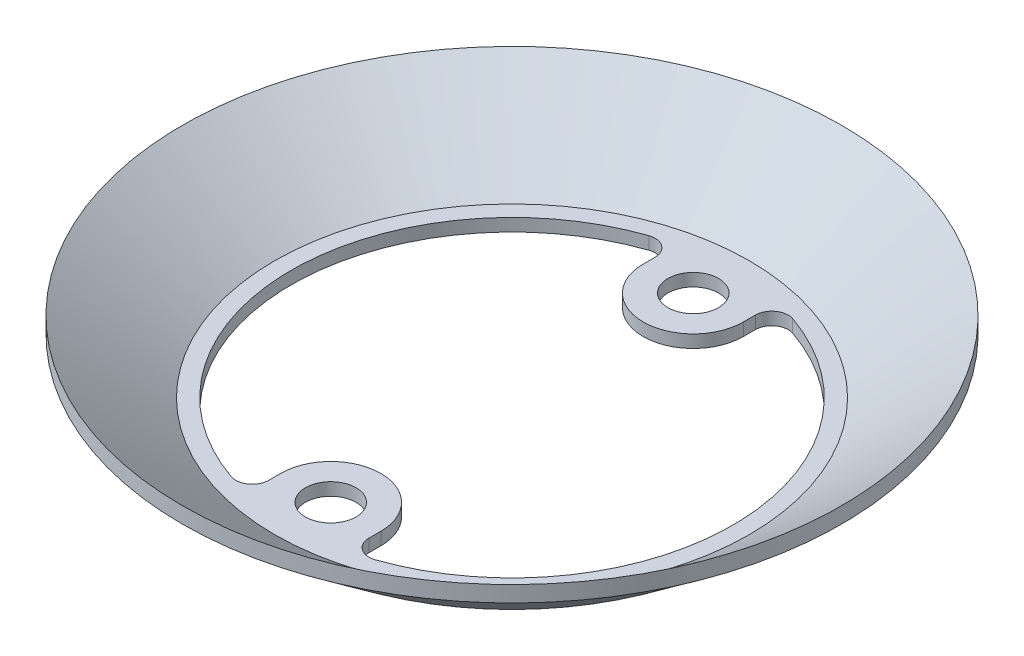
ISO-10303-21;
HEADER;
FILE_DESCRIPTION(('STEP AP214'),'2;1');
FILE_NAME('part.step','',(''),(''),'','','');
FILE_SCHEMA(('AUTOMOTIVE_DESIGN { 1 0 10303 214 1 1 1 1 }'));
ENDSEC;
DATA;
#1=APPLICATION_CONTEXT('core data for automotive mechanical design processes');
#2=APPLICATION_PROTOCOL_DEFINITION('international standard','automotive_design',2000,#1);
#3=PRODUCT_CONTEXT('',#1,'mechanical');
#4=PRODUCT('Part','Part','',(#3));
#5=PRODUCT_RELATED_PRODUCT_CATEGORY('part','',(#4));
#6=PRODUCT_DEFINITION_FORMATION('','',#4);
#7=PRODUCT_DEFINITION_CONTEXT('part definition',#1,'design');
#8=PRODUCT_DEFINITION('design','',#6,#7);
#9=PRODUCT_DEFINITION_SHAPE('','',#8);
#10=(LENGTH_UNIT() NAMED_UNIT(*) SI_UNIT(.MILLI.,.METRE.));
#11=(NAMED_UNIT(*) PLANE_ANGLE_UNIT() SI_UNIT($,.RADIAN.));
#12=(NAMED_UNIT(*) SI_UNIT($,.STERADIAN.) SOLID_ANGLE_UNIT());
#13=UNCERTAINTY_MEASURE_WITH_UNIT(LENGTH_MEASURE(1.E-05),#10,'distance_accuracy_value','');
#14=(GEOMETRIC_REPRESENTATION_CONTEXT(3) GLOBAL_UNCERTAINTY_ASSIGNED_CONTEXT((#13)) GLOBAL_UNIT_ASSIGNED_CONTEXT((#10,
#11,#12)) REPRESENTATION_CONTEXT('',''));
#15=CARTESIAN_POINT('',(0.,0.,0.));
#16=DIRECTION('',(0.,0.,1.));
#17=DIRECTION('',(1.,0.,0.));
#18=AXIS2_PLACEMENT_3D('',#15,#16,#17);
#19=CARTESIAN_POINT('',(0.,0.,0.));
#20=DIRECTION('',(0.,-1.,0.));
#21=DIRECTION('',(0.,0.,-1.));
#22=AXIS2_PLACEMENT_3D('',#19,#20,#21);
#23=CYLINDRICAL_SURFACE('',#22,21.2725);
#24=CARTESIAN_POINT('',(0.,0.,0.));
#25=DIRECTION('',(0.,-1.,0.));
#26=DIRECTION('',(0.,0.,-1.));
#27=AXIS2_PLACEMENT_3D('',#24,#25,#26);
#28=CIRCLE('',#27,21.2725);
#29=CARTESIAN_POINT('',(6.93071774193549,0.,-20.1117977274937));
#30=VERTEX_POINT('',#29);
#31=CARTESIAN_POINT('',(6.93071774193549,0.,20.1117977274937));
#32=VERTEX_POINT('',#31);
#33=EDGE_CURVE('E195',#30,#32,#28,.T.);
#34=ORIENTED_EDGE('',*,*,#33,.T.);
#35=DIRECTION('',(0.,-1.,0.));
#36=VECTOR('',#35,1.);
#37=CARTESIAN_POINT('',(6.93071774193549,0.,20.1117977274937));
#38=LINE('',#37,#36);
#39=CARTESIAN_POINT('',(6.93071774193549,1.2192,20.1117977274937));
#40=VERTEX_POINT('',#39);
#41=EDGE_CURVE('E211',#32,#40,#38,.F.);
#42=ORIENTED_EDGE('',*,*,#41,.T.);
#43=CARTESIAN_POINT('',(0.,1.2192,0.));
#44=DIRECTION('',(0.,-1.,0.));
#45=DIRECTION('',(0.,0.,-1.));
#46=AXIS2_PLACEMENT_3D('',#43,#44,#45);
#47=CIRCLE('',#46,21.2725);
#48=CARTESIAN_POINT('',(6.93071774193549,1.2192,-20.1117977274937));
#49=VERTEX_POINT('',#48);
#50=EDGE_CURVE('E199',#49,#40,#47,.T.);
#51=ORIENTED_EDGE('',*,*,#50,.F.);
#52=DIRECTION('',(0.,-1.,0.));
#53=VECTOR('',#52,1.);
#54=CARTESIAN_POINT('',(6.93071774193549,0.,-20.1117977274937));
#55=LINE('',#54,#53);
#56=EDGE_CURVE('E209',#49,#30,#55,.T.);
#57=ORIENTED_EDGE('',*,*,#56,.T.);
#58=EDGE_LOOP('',(#34,#42,#51,#57));
#59=FACE_BOUND('',#58,.T.);
#60=ADVANCED_FACE('F35',(#59),#23,.F.);
#61=CARTESIAN_POINT('',(-6.93071774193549,1.2192,20.1117977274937));
#62=VERTEX_POINT('',#61);
#63=CARTESIAN_POINT('',(-6.93071774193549,1.2192,-20.1117977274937));
#64=VERTEX_POINT('',#63);
#65=EDGE_CURVE('E196',#62,#64,#47,.T.);
#66=ORIENTED_EDGE('',*,*,#65,.F.);
#67=DIRECTION('',(0.,-1.,0.));
#68=VECTOR('',#67,1.);
#69=CARTESIAN_POINT('',(-6.93071774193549,0.,20.1117977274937));
#70=LINE('',#69,#68);
#71=CARTESIAN_POINT('',(-6.93071774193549,0.,20.1117977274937));
#72=VERTEX_POINT('',#71);
#73=EDGE_CURVE('E218',#62,#72,#70,.T.);
#74=ORIENTED_EDGE('',*,*,#73,.T.);
#75=CARTESIAN_POINT('',(-6.93071774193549,0.,-20.1117977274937));
#76=VERTEX_POINT('',#75);
#77=EDGE_CURVE('E192',#72,#76,#28,.T.);
#78=ORIENTED_EDGE('',*,*,#77,.T.);
#79=DIRECTION('',(0.,-1.,0.));
#80=VECTOR('',#79,1.);
#81=CARTESIAN_POINT('',(-6.93071774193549,0.,-20.1117977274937));
#82=LINE('',#81,#80);
#83=EDGE_CURVE('E216',#76,#64,#82,.F.);
#84=ORIENTED_EDGE('',*,*,#83,.T.);
#85=EDGE_LOOP('',(#66,#74,#78,#84));
#86=FACE_BOUND('',#85,.T.);
#87=ADVANCED_FACE('F263',(#86),#23,.F.);
#88=CARTESIAN_POINT('',(0.,0.,0.));
#89=DIRECTION('',(0.,1.,0.));
#90=DIRECTION('',(0.,0.,1.));
#91=AXIS2_PLACEMENT_3D('',#88,#89,#90);
#92=CONICAL_SURFACE('',#91,23.2756149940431,0.913721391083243);
#93=CARTESIAN_POINT('',(0.,6.53738271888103,0.));
#94=DIRECTION('',(0.,-1.,0.));
#95=DIRECTION('',(0.,0.,-1.));
#96=AXIS2_PLACEMENT_3D('',#93,#94,#95);
#97=CIRCLE('',#96,31.75);
#98=CARTESIAN_POINT('',(0.,6.53738271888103,-31.75));
#99=VERTEX_POINT('',#98);
#100=EDGE_CURVE('E206',#99,#99,#97,.T.);
#101=ORIENTED_EDGE('',*,*,#100,.T.);
#102=EDGE_LOOP('',(#101));
#103=FACE_BOUND('',#102,.T.);
#104=CARTESIAN_POINT('',(0.,0.,0.));
#105=DIRECTION('',(0.,-1.,0.));
#106=DIRECTION('',(0.,0.,-1.));
#107=AXIS2_PLACEMENT_3D('',#104,#105,#106);
#108=CIRCLE('',#107,23.2756149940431);
#109=CARTESIAN_POINT('',(0.,0.,-23.2756149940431));
#110=VERTEX_POINT('',#109);
#111=EDGE_CURVE('E188',#110,#110,#108,.T.);
#112=ORIENTED_EDGE('',*,*,#111,.F.);
#113=EDGE_LOOP('',(#112));
#114=FACE_BOUND('',#113,.T.);
#115=ADVANCED_FACE('F292',(#103,#114),#92,.T.);
#116=CARTESIAN_POINT('',(0.,0.,0.));
#117=DIRECTION('',(0.,-1.,0.));
#118=DIRECTION('',(0.,0.,-1.));
#119=AXIS2_PLACEMENT_3D('',#116,#117,#118);
#120=CYLINDRICAL_SURFACE('',#119,31.75);
#121=CARTESIAN_POINT('',(0.,8.0772,0.));
#122=DIRECTION('',(0.,-1.,0.));
#123=DIRECTION('',(0.,0.,-1.));
#124=AXIS2_PLACEMENT_3D('',#121,#122,#123);
#125=CIRCLE('',#124,31.75);
#126=CARTESIAN_POINT('',(0.,8.0772,-31.75));
#127=VERTEX_POINT('',#126);
#128=EDGE_CURVE('E203',#127,#127,#125,.T.);
#129=ORIENTED_EDGE('',*,*,#128,.T.);
#130=EDGE_LOOP('',(#129));
#131=FACE_BOUND('',#130,.T.);
#132=ORIENTED_EDGE('',*,*,#100,.F.);
#133=EDGE_LOOP('',(#132));
#134=FACE_BOUND('',#133,.T.);
#135=ADVANCED_FACE('F301',(#131,#134),#120,.T.);
#136=CARTESIAN_POINT('',(0.,8.0772,0.));
#137=DIRECTION('',(0.,1.,0.));
#138=DIRECTION('',(0.,0.,1.));
#139=AXIS2_PLACEMENT_3D('',#136,#137,#138);
#140=CONICAL_SURFACE('',#139,31.75,0.913721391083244);
#141=CARTESIAN_POINT('',(0.,1.2192,0.));
#142=DIRECTION('',(0.,-1.,0.));
#143=DIRECTION('',(0.,0.,-1.));
#144=AXIS2_PLACEMENT_3D('',#141,#142,#143);
#145=CIRCLE('',#144,22.86);
#146=CARTESIAN_POINT('',(0.,1.2192,-22.86));
#147=VERTEX_POINT('',#146);
#148=EDGE_CURVE('E200',#147,#147,#145,.T.);
#149=ORIENTED_EDGE('',*,*,#148,.T.);
#150=EDGE_LOOP('',(#149));
#151=FACE_BOUND('',#150,.T.);
#152=ORIENTED_EDGE('',*,*,#128,.F.);
#153=EDGE_LOOP('',(#152));
#154=FACE_BOUND('',#153,.T.);
#155=ADVANCED_FACE('F298',(#151,#154),#140,.F.);
#156=CARTESIAN_POINT('',(0.,1.2192,-22.86));
#157=DIRECTION('',(0.,1.,0.));
#158=DIRECTION('',(0.,0.,1.));
#159=AXIS2_PLACEMENT_3D('',#156,#157,#158);
#160=PLANE('',#159);
#161=DIRECTION('',(0.,0.,-1.));
#162=VECTOR('',#161,1.);
#163=CARTESIAN_POINT('',(4.826,1.2192,-17.4625));
#164=LINE('',#163,#162);
#165=CARTESIAN_POINT('',(4.826,1.2192,-17.4625));
#166=VERTEX_POINT('',#165);
#167=CARTESIAN_POINT('',(4.826,1.2192,-18.6109173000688));
#168=VERTEX_POINT('',#167);
#169=EDGE_CURVE('E181',#166,#168,#164,.T.);
#170=ORIENTED_EDGE('',*,*,#169,.T.);
#171=CARTESIAN_POINT('',(6.4135,1.2192,-18.6109173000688));
#172=DIRECTION('',(0.,1.,0.));
#173=DIRECTION('',(0.,0.,1.));
#174=AXIS2_PLACEMENT_3D('',#171,#172,#173);
#175=CIRCLE('',#174,1.5875);
#176=EDGE_CURVE('E43',#168,#49,#175,.F.);
#177=ORIENTED_EDGE('',*,*,#176,.T.);
#178=ORIENTED_EDGE('',*,*,#50,.T.);
#179=CARTESIAN_POINT('',(6.4135,1.2192,18.6109173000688));
#180=DIRECTION('',(0.,1.,0.));
#181=DIRECTION('',(0.,0.,1.));
#182=AXIS2_PLACEMENT_3D('',#179,#180,#181);
#183=CIRCLE('',#182,1.5875);
#184=CARTESIAN_POINT('',(4.826,1.2192,18.6109173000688));
#185=VERTEX_POINT('',#184);
#186=EDGE_CURVE('E228',#40,#185,#183,.F.);
#187=ORIENTED_EDGE('',*,*,#186,.T.);
#188=DIRECTION('',(0.,0.,1.));
#189=VECTOR('',#188,1.);
#190=CARTESIAN_POINT('',(4.826,1.2192,17.4625));
#191=LINE('',#190,#189);
#192=CARTESIAN_POINT('',(4.826,1.2192,17.4625));
#193=VERTEX_POINT('',#192);
#194=EDGE_CURVE('E149',#193,#185,#191,.T.);
#195=ORIENTED_EDGE('',*,*,#194,.F.);
#196=CARTESIAN_POINT('',(0.,1.2192,17.4625));
#197=DIRECTION('',(0.,-1.,0.));
#198=DIRECTION('',(0.,0.,-1.));
#199=AXIS2_PLACEMENT_3D('',#196,#197,#198);
#200=CIRCLE('',#199,4.826);
#201=CARTESIAN_POINT('',(-4.826,1.2192,17.4625));
#202=VERTEX_POINT('',#201);
#203=EDGE_CURVE('E158',#202,#193,#200,.T.);
#204=ORIENTED_EDGE('',*,*,#203,.F.);
#205=DIRECTION('',(0.,0.,-1.));
#206=VECTOR('',#205,1.);
#207=CARTESIAN_POINT('',(-4.826,1.2192,17.4625));
#208=LINE('',#207,#206);
#209=CARTESIAN_POINT('',(-4.826,1.2192,18.6109173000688));
#210=VERTEX_POINT('',#209);
#211=EDGE_CURVE('E141',#210,#202,#208,.T.);
#212=ORIENTED_EDGE('',*,*,#211,.F.);
#213=CARTESIAN_POINT('',(-6.4135,1.2192,18.6109173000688));
#214=DIRECTION('',(0.,1.,0.));
#215=DIRECTION('',(0.,0.,1.));
#216=AXIS2_PLACEMENT_3D('',#213,#214,#215);
#217=CIRCLE('',#216,1.5875);
#218=EDGE_CURVE('E233',#210,#62,#217,.F.);
#219=ORIENTED_EDGE('',*,*,#218,.T.);
#220=ORIENTED_EDGE('',*,*,#65,.T.);
#221=CARTESIAN_POINT('',(-6.4135,1.2192,-18.6109173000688));
#222=DIRECTION('',(0.,1.,0.));
#223=DIRECTION('',(0.,0.,1.));
#224=AXIS2_PLACEMENT_3D('',#221,#222,#223);
#225=CIRCLE('',#224,1.5875);
#226=CARTESIAN_POINT('',(-4.826,1.2192,-18.6109173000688));
#227=VERTEX_POINT('',#226);
#228=EDGE_CURVE('E237',#64,#227,#225,.F.);
#229=ORIENTED_EDGE('',*,*,#228,.T.);
#230=DIRECTION('',(0.,0.,1.));
#231=VECTOR('',#230,1.);
#232=CARTESIAN_POINT('',(-4.826,1.2192,-17.4625));
#233=LINE('',#232,#231);
#234=CARTESIAN_POINT('',(-4.826,1.2192,-17.4625));
#235=VERTEX_POINT('',#234);
#236=EDGE_CURVE('E174',#227,#235,#233,.T.);
#237=ORIENTED_EDGE('',*,*,#236,.T.);
#238=CARTESIAN_POINT('',(0.,1.2192,-17.4625));
#239=DIRECTION('',(0.,1.,0.));
#240=DIRECTION('',(0.,0.,1.));
#241=AXIS2_PLACEMENT_3D('',#238,#239,#240);
#242=CIRCLE('',#241,4.826);
#243=EDGE_CURVE('E167',#235,#166,#242,.T.);
#244=ORIENTED_EDGE('',*,*,#243,.T.);
#245=EDGE_LOOP('',(#170,#177,#178,#187,#195,#204,#212,#219,#220,#229,#237,#244));
#246=FACE_BOUND('',#245,.T.);
#247=CARTESIAN_POINT('',(0.,1.2192,17.4625));
#248=DIRECTION('',(0.,-1.,0.));
#249=DIRECTION('',(0.,0.,-1.));
#250=AXIS2_PLACEMENT_3D('',#247,#248,#249);
#251=CIRCLE('',#250,2.4384);
#252=CARTESIAN_POINT('',(0.,1.2192,15.0241));
#253=VERTEX_POINT('',#252);
#254=EDGE_CURVE('E154',#253,#253,#251,.T.);
#255=ORIENTED_EDGE('',*,*,#254,.T.);
#256=EDGE_LOOP('',(#255));
#257=FACE_BOUND('',#256,.T.);
#258=CARTESIAN_POINT('',(0.,1.2192,-17.4625));
#259=DIRECTION('',(0.,1.,0.));
#260=DIRECTION('',(0.,0.,1.));
#261=AXIS2_PLACEMENT_3D('',#258,#259,#260);
#262=CIRCLE('',#261,2.4384);
#263=CARTESIAN_POINT('',(0.,1.2192,-15.0241));
#264=VERTEX_POINT('',#263);
#265=EDGE_CURVE('E162',#264,#264,#262,.T.);
#266=ORIENTED_EDGE('',*,*,#265,.F.);
#267=EDGE_LOOP('',(#266));
#268=FACE_BOUND('',#267,.T.);
#269=ORIENTED_EDGE('',*,*,#148,.F.);
#270=EDGE_LOOP('',(#269));
#271=FACE_BOUND('',#270,.T.);
#272=ADVANCED_FACE('F241',(#246,#257,#268,#271),#160,.T.);
#273=CARTESIAN_POINT('',(0.,0.,-23.2756149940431));
#274=DIRECTION('',(0.,-1.,0.));
#275=DIRECTION('',(0.,0.,-1.));
#276=AXIS2_PLACEMENT_3D('',#273,#274,#275);
#277=PLANE('',#276);
#278=ORIENTED_EDGE('',*,*,#77,.F.);
#279=CARTESIAN_POINT('',(-6.4135,0.,18.6109173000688));
#280=DIRECTION('',(0.,-1.,0.));
#281=DIRECTION('',(0.,0.,-1.));
#282=AXIS2_PLACEMENT_3D('',#279,#280,#281);
#283=CIRCLE('',#282,1.5875);
#284=CARTESIAN_POINT('',(-4.826,0.,18.6109173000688));
#285=VERTEX_POINT('',#284);
#286=EDGE_CURVE('E132',#72,#285,#283,.F.);
#287=ORIENTED_EDGE('',*,*,#286,.T.);
#288=DIRECTION('',(0.,0.,-1.));
#289=VECTOR('',#288,1.);
#290=CARTESIAN_POINT('',(-4.826,0.,17.4625));
#291=LINE('',#290,#289);
#292=CARTESIAN_POINT('',(-4.826,0.,17.4625));
#293=VERTEX_POINT('',#292);
#294=EDGE_CURVE('E123',#285,#293,#291,.T.);
#295=ORIENTED_EDGE('',*,*,#294,.T.);
#296=CARTESIAN_POINT('',(0.,0.,17.4625));
#297=DIRECTION('',(0.,-1.,0.));
#298=DIRECTION('',(0.,0.,-1.));
#299=AXIS2_PLACEMENT_3D('',#296,#297,#298);
#300=CIRCLE('',#299,4.826);
#301=CARTESIAN_POINT('',(4.826,0.,17.4625));
#302=VERTEX_POINT('',#301);
#303=EDGE_CURVE('E130',#293,#302,#300,.T.);
#304=ORIENTED_EDGE('',*,*,#303,.T.);
#305=DIRECTION('',(0.,0.,1.));
#306=VECTOR('',#305,1.);
#307=CARTESIAN_POINT('',(4.826,0.,17.4625));
#308=LINE('',#307,#306);
#309=CARTESIAN_POINT('',(4.826,0.,18.6109173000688));
#310=VERTEX_POINT('',#309);
#311=EDGE_CURVE('E135',#302,#310,#308,.T.);
#312=ORIENTED_EDGE('',*,*,#311,.T.);
#313=CARTESIAN_POINT('',(6.4135,0.,18.6109173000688));
#314=DIRECTION('',(0.,-1.,0.));
#315=DIRECTION('',(0.,0.,-1.));
#316=AXIS2_PLACEMENT_3D('',#313,#314,#315);
#317=CIRCLE('',#316,1.5875);
#318=EDGE_CURVE('E230',#310,#32,#317,.F.);
#319=ORIENTED_EDGE('',*,*,#318,.T.);
#320=ORIENTED_EDGE('',*,*,#33,.F.);
#321=CARTESIAN_POINT('',(6.4135,0.,-18.6109173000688));
#322=DIRECTION('',(0.,-1.,0.));
#323=DIRECTION('',(0.,0.,-1.));
#324=AXIS2_PLACEMENT_3D('',#321,#322,#323);
#325=CIRCLE('',#324,1.5875);
#326=CARTESIAN_POINT('',(4.826,0.,-18.6109173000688));
#327=VERTEX_POINT('',#326);
#328=EDGE_CURVE('E11',#30,#327,#325,.F.);
#329=ORIENTED_EDGE('',*,*,#328,.T.);
#330=DIRECTION('',(0.,0.,-1.));
#331=VECTOR('',#330,1.);
#332=CARTESIAN_POINT('',(4.826,0.,-17.4625));
#333=LINE('',#332,#331);
#334=CARTESIAN_POINT('',(4.826,0.,-17.4625));
#335=VERTEX_POINT('',#334);
#336=EDGE_CURVE('E173',#335,#327,#333,.T.);
#337=ORIENTED_EDGE('',*,*,#336,.F.);
#338=CARTESIAN_POINT('',(0.,0.,-17.4625));
#339=DIRECTION('',(0.,1.,0.));
#340=DIRECTION('',(0.,0.,1.));
#341=AXIS2_PLACEMENT_3D('',#338,#339,#340);
#342=CIRCLE('',#341,4.826);
#343=CARTESIAN_POINT('',(-4.826,0.,-17.4625));
#344=VERTEX_POINT('',#343);
#345=EDGE_CURVE('E170',#344,#335,#342,.T.);
#346=ORIENTED_EDGE('',*,*,#345,.F.);
#347=DIRECTION('',(0.,0.,1.));
#348=VECTOR('',#347,1.);
#349=CARTESIAN_POINT('',(-4.826,0.,-17.4625));
#350=LINE('',#349,#348);
#351=CARTESIAN_POINT('',(-4.826,0.,-18.6109173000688));
#352=VERTEX_POINT('',#351);
#353=EDGE_CURVE('E176',#352,#344,#350,.T.);
#354=ORIENTED_EDGE('',*,*,#353,.F.);
#355=CARTESIAN_POINT('',(-6.4135,0.,-18.6109173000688));
#356=DIRECTION('',(0.,-1.,0.));
#357=DIRECTION('',(0.,0.,-1.));
#358=AXIS2_PLACEMENT_3D('',#355,#356,#357);
#359=CIRCLE('',#358,1.5875);
#360=EDGE_CURVE('E235',#352,#76,#359,.F.);
#361=ORIENTED_EDGE('',*,*,#360,.T.);
#362=EDGE_LOOP('',(#278,#287,#295,#304,#312,#319,#320,#329,#337,#346,#354,#361));
#363=FACE_BOUND('',#362,.T.);
#364=CARTESIAN_POINT('',(0.,0.,-17.4625));
#365=DIRECTION('',(0.,1.,0.));
#366=DIRECTION('',(0.,0.,1.));
#367=AXIS2_PLACEMENT_3D('',#364,#365,#366);
#368=CIRCLE('',#367,2.4384);
#369=CARTESIAN_POINT('',(0.,0.,-15.0241));
#370=VERTEX_POINT('',#369);
#371=EDGE_CURVE('E164',#370,#370,#368,.T.);
#372=ORIENTED_EDGE('',*,*,#371,.T.);
#373=EDGE_LOOP('',(#372));
#374=FACE_BOUND('',#373,.T.);
#375=ORIENTED_EDGE('',*,*,#111,.T.);
#376=EDGE_LOOP('',(#375));
#377=FACE_BOUND('',#376,.T.);
#378=CARTESIAN_POINT('',(0.,0.,17.4625));
#379=DIRECTION('',(0.,-1.,0.));
#380=DIRECTION('',(0.,0.,-1.));
#381=AXIS2_PLACEMENT_3D('',#378,#379,#380);
#382=CIRCLE('',#381,2.4384);
#383=CARTESIAN_POINT('',(0.,0.,15.0241));
#384=VERTEX_POINT('',#383);
#385=EDGE_CURVE('E160',#384,#384,#382,.T.);
#386=ORIENTED_EDGE('',*,*,#385,.F.);
#387=EDGE_LOOP('',(#386));
#388=FACE_BOUND('',#387,.T.);
#389=ADVANCED_FACE('F126',(#363,#374,#377,#388),#277,.T.);
#390=CARTESIAN_POINT('',(0.,0.,-17.4625));
#391=DIRECTION('',(0.,1.,0.));
#392=DIRECTION('',(0.,0.,1.));
#393=AXIS2_PLACEMENT_3D('',#390,#391,#392);
#394=CYLINDRICAL_SURFACE('',#393,4.826);
#395=ORIENTED_EDGE('',*,*,#243,.F.);
#396=DIRECTION('',(0.,1.,0.));
#397=VECTOR('',#396,1.);
#398=CARTESIAN_POINT('',(-4.826,0.,-17.4625));
#399=LINE('',#398,#397);
#400=EDGE_CURVE('E185',#344,#235,#399,.T.);
#401=ORIENTED_EDGE('',*,*,#400,.F.);
#402=ORIENTED_EDGE('',*,*,#345,.T.);
#403=DIRECTION('',(0.,1.,0.));
#404=VECTOR('',#403,1.);
#405=CARTESIAN_POINT('',(4.826,0.,-17.4625));
#406=LINE('',#405,#404);
#407=EDGE_CURVE('E178',#335,#166,#406,.T.);
#408=ORIENTED_EDGE('',*,*,#407,.T.);
#409=EDGE_LOOP('',(#395,#401,#402,#408));
#410=FACE_BOUND('',#409,.T.);
#411=ADVANCED_FACE('F254',(#410),#394,.T.);
#412=CARTESIAN_POINT('',(-4.826,0.,-17.4625));
#413=DIRECTION('',(-1.,0.,0.));
#414=DIRECTION('',(0.,0.,1.));
#415=AXIS2_PLACEMENT_3D('',#412,#413,#414);
#416=PLANE('',#415);
#417=ORIENTED_EDGE('',*,*,#236,.F.);
#418=DIRECTION('',(0.,1.,0.));
#419=VECTOR('',#418,1.);
#420=CARTESIAN_POINT('',(-4.826,0.,-18.6109173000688));
#421=LINE('',#420,#419);
#422=EDGE_CURVE('E223',#227,#352,#421,.F.);
#423=ORIENTED_EDGE('',*,*,#422,.T.);
#424=ORIENTED_EDGE('',*,*,#353,.T.);
#425=ORIENTED_EDGE('',*,*,#400,.T.);
#426=EDGE_LOOP('',(#417,#423,#424,#425));
#427=FACE_BOUND('',#426,.T.);
#428=ADVANCED_FACE('F257',(#427),#416,.T.);
#429=CARTESIAN_POINT('',(4.826,0.,-17.4625));
#430=DIRECTION('',(1.,0.,0.));
#431=DIRECTION('',(0.,0.,-1.));
#432=AXIS2_PLACEMENT_3D('',#429,#430,#431);
#433=PLANE('',#432);
#434=ORIENTED_EDGE('',*,*,#336,.T.);
#435=DIRECTION('',(0.,1.,0.));
#436=VECTOR('',#435,1.);
#437=CARTESIAN_POINT('',(4.826,1.2192,-18.6109173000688));
#438=LINE('',#437,#436);
#439=EDGE_CURVE('E226',#327,#168,#438,.T.);
#440=ORIENTED_EDGE('',*,*,#439,.T.);
#441=ORIENTED_EDGE('',*,*,#169,.F.);
#442=ORIENTED_EDGE('',*,*,#407,.F.);
#443=EDGE_LOOP('',(#434,#440,#441,#442));
#444=FACE_BOUND('',#443,.T.);
#445=ADVANCED_FACE('F248',(#444),#433,.T.);
#446=CARTESIAN_POINT('',(0.,0.,-17.4625));
#447=DIRECTION('',(0.,1.,0.));
#448=DIRECTION('',(0.,0.,1.));
#449=AXIS2_PLACEMENT_3D('',#446,#447,#448);
#450=CYLINDRICAL_SURFACE('',#449,2.4384);
#451=ORIENTED_EDGE('',*,*,#371,.F.);
#452=EDGE_LOOP('',(#451));
#453=FACE_BOUND('',#452,.T.);
#454=ORIENTED_EDGE('',*,*,#265,.T.);
#455=EDGE_LOOP('',(#454));
#456=FACE_BOUND('',#455,.T.);
#457=ADVANCED_FACE('F328',(#453,#456),#450,.F.);
#458=CARTESIAN_POINT('',(0.,0.,17.4625));
#459=DIRECTION('',(0.,1.,0.));
#460=DIRECTION('',(0.,0.,1.));
#461=AXIS2_PLACEMENT_3D('',#458,#459,#460);
#462=CYLINDRICAL_SURFACE('',#461,4.826);
#463=ORIENTED_EDGE('',*,*,#203,.T.);
#464=DIRECTION('',(0.,1.,0.));
#465=VECTOR('',#464,1.);
#466=CARTESIAN_POINT('',(4.826,0.,17.4625));
#467=LINE('',#466,#465);
#468=EDGE_CURVE('E145',#302,#193,#467,.T.);
#469=ORIENTED_EDGE('',*,*,#468,.F.);
#470=ORIENTED_EDGE('',*,*,#303,.F.);
#471=DIRECTION('',(0.,1.,0.));
#472=VECTOR('',#471,1.);
#473=CARTESIAN_POINT('',(-4.826,0.,17.4625));
#474=LINE('',#473,#472);
#475=EDGE_CURVE('E138',#293,#202,#474,.T.);
#476=ORIENTED_EDGE('',*,*,#475,.T.);
#477=EDGE_LOOP('',(#463,#469,#470,#476));
#478=FACE_BOUND('',#477,.T.);
#479=ADVANCED_FACE('F147',(#478),#462,.T.);
#480=CARTESIAN_POINT('',(4.826,0.,17.4625));
#481=DIRECTION('',(-1.,0.,0.));
#482=DIRECTION('',(0.,0.,1.));
#483=AXIS2_PLACEMENT_3D('',#480,#481,#482);
#484=PLANE('',#483);
#485=ORIENTED_EDGE('',*,*,#194,.T.);
#486=DIRECTION('',(0.,-1.,0.));
#487=VECTOR('',#486,1.);
#488=CARTESIAN_POINT('',(4.826,0.,18.6109173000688));
#489=LINE('',#488,#487);
#490=EDGE_CURVE('E214',#185,#310,#489,.T.);
#491=ORIENTED_EDGE('',*,*,#490,.T.);
#492=ORIENTED_EDGE('',*,*,#311,.F.);
#493=ORIENTED_EDGE('',*,*,#468,.T.);
#494=EDGE_LOOP('',(#485,#491,#492,#493));
#495=FACE_BOUND('',#494,.T.);
#496=ADVANCED_FACE('F272',(#495),#484,.F.);
#497=CARTESIAN_POINT('',(-4.826,0.,17.4625));
#498=DIRECTION('',(1.,0.,0.));
#499=DIRECTION('',(0.,0.,-1.));
#500=AXIS2_PLACEMENT_3D('',#497,#498,#499);
#501=PLANE('',#500);
#502=ORIENTED_EDGE('',*,*,#294,.F.);
#503=DIRECTION('',(0.,-1.,0.));
#504=VECTOR('',#503,1.);
#505=CARTESIAN_POINT('',(-4.826,0.,18.6109173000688));
#506=LINE('',#505,#504);
#507=EDGE_CURVE('E221',#285,#210,#506,.F.);
#508=ORIENTED_EDGE('',*,*,#507,.T.);
#509=ORIENTED_EDGE('',*,*,#211,.T.);
#510=ORIENTED_EDGE('',*,*,#475,.F.);
#511=EDGE_LOOP('',(#502,#508,#509,#510));
#512=FACE_BOUND('',#511,.T.);
#513=ADVANCED_FACE('F139',(#512),#501,.F.);
#514=CARTESIAN_POINT('',(0.,0.,17.4625));
#515=DIRECTION('',(0.,1.,0.));
#516=DIRECTION('',(0.,0.,1.));
#517=AXIS2_PLACEMENT_3D('',#514,#515,#516);
#518=CYLINDRICAL_SURFACE('',#517,2.4384);
#519=ORIENTED_EDGE('',*,*,#385,.T.);
#520=EDGE_LOOP('',(#519));
#521=FACE_BOUND('',#520,.T.);
#522=ORIENTED_EDGE('',*,*,#254,.F.);
#523=EDGE_LOOP('',(#522));
#524=FACE_BOUND('',#523,.T.);
#525=ADVANCED_FACE('F277',(#521,#524),#518,.F.);
#526=CARTESIAN_POINT('',(6.4135,0.,18.6109173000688));
#527=DIRECTION('',(0.,-1.,0.));
#528=DIRECTION('',(0.,0.,-1.));
#529=AXIS2_PLACEMENT_3D('',#526,#527,#528);
#530=CYLINDRICAL_SURFACE('',#529,1.5875);
#531=ORIENTED_EDGE('',*,*,#318,.F.);
#532=ORIENTED_EDGE('',*,*,#490,.F.);
#533=ORIENTED_EDGE('',*,*,#186,.F.);
#534=ORIENTED_EDGE('',*,*,#41,.F.);
#535=EDGE_LOOP('',(#531,#532,#533,#534));
#536=FACE_BOUND('',#535,.T.);
#537=ADVANCED_FACE('F275',(#536),#530,.F.);
#538=CARTESIAN_POINT('',(-6.4135,0.,18.6109173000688));
#539=DIRECTION('',(0.,-1.,0.));
#540=DIRECTION('',(0.,0.,-1.));
#541=AXIS2_PLACEMENT_3D('',#538,#539,#540);
#542=CYLINDRICAL_SURFACE('',#541,1.5875);
#543=ORIENTED_EDGE('',*,*,#218,.F.);
#544=ORIENTED_EDGE('',*,*,#507,.F.);
#545=ORIENTED_EDGE('',*,*,#286,.F.);
#546=ORIENTED_EDGE('',*,*,#73,.F.);
#547=EDGE_LOOP('',(#543,#544,#545,#546));
#548=FACE_BOUND('',#547,.T.);
#549=ADVANCED_FACE('F269',(#548),#542,.F.);
#550=CARTESIAN_POINT('',(-6.4135,0.,-18.6109173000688));
#551=DIRECTION('',(0.,-1.,0.));
#552=DIRECTION('',(0.,0.,-1.));
#553=AXIS2_PLACEMENT_3D('',#550,#551,#552);
#554=CYLINDRICAL_SURFACE('',#553,1.5875);
#555=ORIENTED_EDGE('',*,*,#228,.F.);
#556=ORIENTED_EDGE('',*,*,#83,.F.);
#557=ORIENTED_EDGE('',*,*,#360,.F.);
#558=ORIENTED_EDGE('',*,*,#422,.F.);
#559=EDGE_LOOP('',(#555,#556,#557,#558));
#560=FACE_BOUND('',#559,.T.);
#561=ADVANCED_FACE('F266',(#560),#554,.F.);
#562=CARTESIAN_POINT('',(6.4135,0.,-18.6109173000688));
#563=DIRECTION('',(0.,-1.,0.));
#564=DIRECTION('',(0.,0.,-1.));
#565=AXIS2_PLACEMENT_3D('',#562,#563,#564);
#566=CYLINDRICAL_SURFACE('',#565,1.5875);
#567=ORIENTED_EDGE('',*,*,#328,.F.);
#568=ORIENTED_EDGE('',*,*,#56,.F.);
#569=ORIENTED_EDGE('',*,*,#176,.F.);
#570=ORIENTED_EDGE('',*,*,#439,.F.);
#571=EDGE_LOOP('',(#567,#568,#569,#570));
#572=FACE_BOUND('',#571,.T.);
#573=ADVANCED_FACE('F37',(#572),#566,.F.);
#574=CLOSED_SHELL('',(#60,#87,#115,#135,#155,#272,#389,#411,#428,#445,#457,#479,#496,#513,#525,
#537,#549,#561,#573));
#575=MANIFOLD_SOLID_BREP('B2',#574);
#576=ADVANCED_BREP_SHAPE_REPRESENTATION('',(#18,#575),#14);
#577=SHAPE_DEFINITION_REPRESENTATION(#9,#576);
ENDSEC;
END-ISO-10303-21;
